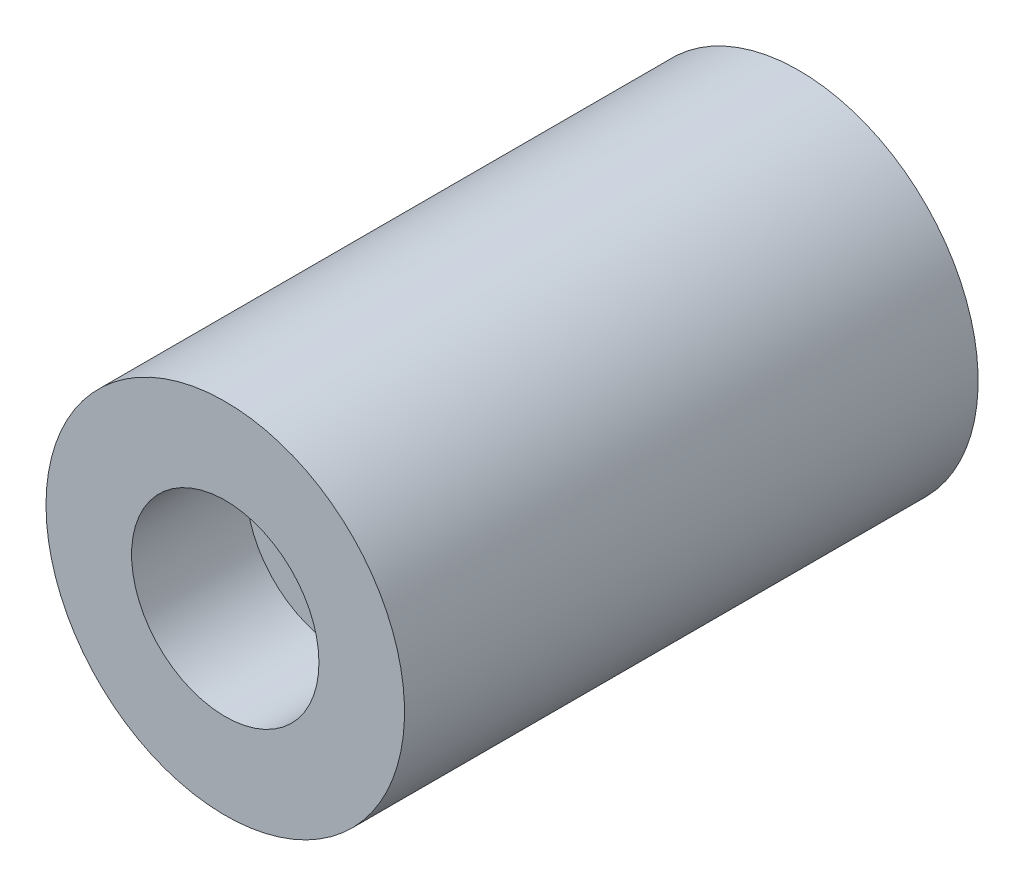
ISO-10303-21;
HEADER;
FILE_DESCRIPTION(('STEP AP214'),'2;1');
FILE_NAME('part.step','',(''),(''),'','','');
FILE_SCHEMA(('AUTOMOTIVE_DESIGN { 1 0 10303 214 1 1 1 1 }'));
ENDSEC;
DATA;
#1=APPLICATION_CONTEXT('core data for automotive mechanical design processes');
#2=APPLICATION_PROTOCOL_DEFINITION('international standard','automotive_design',2000,#1);
#3=PRODUCT_CONTEXT('',#1,'mechanical');
#4=PRODUCT('Part','Part','',(#3));
#5=PRODUCT_RELATED_PRODUCT_CATEGORY('part','',(#4));
#6=PRODUCT_DEFINITION_FORMATION('','',#4);
#7=PRODUCT_DEFINITION_CONTEXT('part definition',#1,'design');
#8=PRODUCT_DEFINITION('design','',#6,#7);
#9=PRODUCT_DEFINITION_SHAPE('','',#8);
#10=(LENGTH_UNIT() NAMED_UNIT(*) SI_UNIT(.MILLI.,.METRE.));
#11=(NAMED_UNIT(*) PLANE_ANGLE_UNIT() SI_UNIT($,.RADIAN.));
#12=(NAMED_UNIT(*) SI_UNIT($,.STERADIAN.) SOLID_ANGLE_UNIT());
#13=UNCERTAINTY_MEASURE_WITH_UNIT(LENGTH_MEASURE(1.E-05),#10,'distance_accuracy_value','');
#14=(GEOMETRIC_REPRESENTATION_CONTEXT(3) GLOBAL_UNCERTAINTY_ASSIGNED_CONTEXT((#13)) GLOBAL_UNIT_ASSIGNED_CONTEXT((#10,
#11,#12)) REPRESENTATION_CONTEXT('',''));
#15=CARTESIAN_POINT('',(0.,0.,0.));
#16=DIRECTION('',(0.,0.,1.));
#17=DIRECTION('',(1.,0.,0.));
#18=AXIS2_PLACEMENT_3D('',#15,#16,#17);
#19=CARTESIAN_POINT('',(0.,0.,7.62));
#20=DIRECTION('',(0.,0.,-0.999999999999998));
#21=DIRECTION('',(-1.00000000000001,0.,0.));
#22=AXIS2_PLACEMENT_3D('',#19,#20,#21);
#23=CYLINDRICAL_SURFACE('',#22,2.38125);
#24=CARTESIAN_POINT('',(0.,0.,7.62));
#25=DIRECTION('',(0.,0.,0.999999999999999));
#26=DIRECTION('',(1.00000000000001,0.,0.));
#27=AXIS2_PLACEMENT_3D('',#24,#25,#26);
#28=CIRCLE('',#27,2.38125);
#29=CARTESIAN_POINT('',(-2.38125000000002,0.,7.62));
#30=VERTEX_POINT('',#29);
#31=EDGE_CURVE('E11',#30,#30,#28,.T.);
#32=CARTESIAN_POINT('',(0.,0.,0.));
#33=DIRECTION('',(0.,0.,0.999999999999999));
#34=DIRECTION('',(1.00000000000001,0.,0.));
#35=AXIS2_PLACEMENT_3D('',#32,#33,#34);
#36=CIRCLE('',#35,2.38125);
#37=CARTESIAN_POINT('',(-2.38125000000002,0.,0.));
#38=VERTEX_POINT('',#37);
#39=EDGE_CURVE('E38',#38,#38,#36,.T.);
#40=CARTESIAN_POINT('',(-2.38125000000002,0.,7.62));
#41=CARTESIAN_POINT('',(-2.38125000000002,0.,7.540625));
#42=CARTESIAN_POINT('',(-2.38125000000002,0.,7.46125));
#43=CARTESIAN_POINT('',(-2.38125000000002,0.,7.3025));
#44=CARTESIAN_POINT('',(-2.38125000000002,0.,7.223125));
#45=CARTESIAN_POINT('',(-2.38125000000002,0.,7.064375));
#46=CARTESIAN_POINT('',(-2.38125000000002,0.,6.985));
#47=CARTESIAN_POINT('',(-2.38125000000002,0.,6.82625));
#48=CARTESIAN_POINT('',(-2.38125000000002,0.,6.746875));
#49=CARTESIAN_POINT('',(-2.38125000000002,0.,6.588125));
#50=CARTESIAN_POINT('',(-2.38125000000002,0.,6.50875));
#51=CARTESIAN_POINT('',(-2.38125000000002,0.,6.35));
#52=CARTESIAN_POINT('',(-2.38125000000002,0.,6.270625));
#53=CARTESIAN_POINT('',(-2.38125000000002,0.,6.111875));
#54=CARTESIAN_POINT('',(-2.38125000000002,0.,6.0325));
#55=CARTESIAN_POINT('',(-2.38125000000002,0.,5.87375));
#56=CARTESIAN_POINT('',(-2.38125000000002,0.,5.794375));
#57=CARTESIAN_POINT('',(-2.38125000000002,0.,5.635625));
#58=CARTESIAN_POINT('',(-2.38125000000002,0.,5.55625));
#59=CARTESIAN_POINT('',(-2.38125000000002,0.,5.3975));
#60=CARTESIAN_POINT('',(-2.38125000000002,0.,5.318125));
#61=CARTESIAN_POINT('',(-2.38125000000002,0.,5.159375));
#62=CARTESIAN_POINT('',(-2.38125000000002,0.,5.08));
#63=CARTESIAN_POINT('',(-2.38125000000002,0.,4.92125));
#64=CARTESIAN_POINT('',(-2.38125000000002,0.,4.841875));
#65=CARTESIAN_POINT('',(-2.38125000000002,0.,4.683125));
#66=CARTESIAN_POINT('',(-2.38125000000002,0.,4.60375));
#67=CARTESIAN_POINT('',(-2.38125000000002,0.,4.445));
#68=CARTESIAN_POINT('',(-2.38125000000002,0.,4.365625));
#69=CARTESIAN_POINT('',(-2.38125000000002,0.,4.206875));
#70=CARTESIAN_POINT('',(-2.38125000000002,0.,4.1275));
#71=CARTESIAN_POINT('',(-2.38125000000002,0.,3.96875));
#72=CARTESIAN_POINT('',(-2.38125000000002,0.,3.889375));
#73=CARTESIAN_POINT('',(-2.38125000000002,0.,3.730625));
#74=CARTESIAN_POINT('',(-2.38125000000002,0.,3.65125));
#75=CARTESIAN_POINT('',(-2.38125000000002,0.,3.4925));
#76=CARTESIAN_POINT('',(-2.38125000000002,0.,3.413125));
#77=CARTESIAN_POINT('',(-2.38125000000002,0.,3.254375));
#78=CARTESIAN_POINT('',(-2.38125000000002,0.,3.175));
#79=CARTESIAN_POINT('',(-2.38125000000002,0.,3.01625));
#80=CARTESIAN_POINT('',(-2.38125000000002,0.,2.936875));
#81=CARTESIAN_POINT('',(-2.38125000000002,0.,2.778125));
#82=CARTESIAN_POINT('',(-2.38125000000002,0.,2.69875));
#83=CARTESIAN_POINT('',(-2.38125000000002,0.,2.54));
#84=CARTESIAN_POINT('',(-2.38125000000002,0.,2.460625));
#85=CARTESIAN_POINT('',(-2.38125000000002,0.,2.301875));
#86=CARTESIAN_POINT('',(-2.38125000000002,0.,2.2225));
#87=CARTESIAN_POINT('',(-2.38125000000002,0.,2.06375));
#88=CARTESIAN_POINT('',(-2.38125000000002,0.,1.984375));
#89=CARTESIAN_POINT('',(-2.38125000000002,0.,1.825625));
#90=CARTESIAN_POINT('',(-2.38125000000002,0.,1.74625));
#91=CARTESIAN_POINT('',(-2.38125000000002,0.,1.5875));
#92=CARTESIAN_POINT('',(-2.38125000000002,0.,1.508125));
#93=CARTESIAN_POINT('',(-2.38125000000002,0.,1.349375));
#94=CARTESIAN_POINT('',(-2.38125000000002,0.,1.27));
#95=CARTESIAN_POINT('',(-2.38125000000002,0.,1.11125));
#96=CARTESIAN_POINT('',(-2.38125000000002,0.,1.031875));
#97=CARTESIAN_POINT('',(-2.38125000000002,0.,0.873125));
#98=CARTESIAN_POINT('',(-2.38125000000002,0.,0.79375));
#99=CARTESIAN_POINT('',(-2.38125000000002,0.,0.635));
#100=CARTESIAN_POINT('',(-2.38125000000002,0.,0.555625));
#101=CARTESIAN_POINT('',(-2.38125000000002,0.,0.396875));
#102=CARTESIAN_POINT('',(-2.38125000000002,0.,0.3175));
#103=CARTESIAN_POINT('',(-2.38125000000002,0.,0.15875));
#104=CARTESIAN_POINT('',(-2.38125000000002,0.,0.0793749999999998));
#105=CARTESIAN_POINT('',(-2.38125000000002,0.,0.));
#106=B_SPLINE_CURVE_WITH_KNOTS('',3,(#40,#41,#42,#43,#44,#45,#46,#47,#48,#49,#50,#51,#52,#53,
#54,#55,#56,#57,#58,#59,#60,#61,#62,#63,#64,#65,#66,#67,#68,#69,#70,#71,#72,#73,#74,#75,#76,#77,
#78,#79,#80,#81,#82,#83,#84,#85,#86,#87,#88,#89,#90,#91,#92,#93,#94,#95,#96,#97,#98,#99,#100,
#101,#102,#103,#104,#105),.UNSPECIFIED.,.F.,.F.,(4,2,2,2,2,2,2,2,2,2,2,2,2,2,2,2,2,2,2,2,2,2,2,
2,2,2,2,2,2,2,2,2,4),(0.,0.238125,0.476250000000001,0.714375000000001,0.952500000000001,
1.190625,1.42875,1.666875,1.905,2.143125,2.38125,2.619375,2.8575,3.095625,3.33375,3.571875,3.81,
4.048125,4.28625,4.524375,4.7625,5.000625,5.23875,5.476875,5.715,5.953125,6.19125,6.429375,
6.6675,6.90562500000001,7.14375,7.381875,7.62),.UNSPECIFIED.);
#107=EDGE_CURVE('BSEAM32',#30,#38,#106,.T.);
#108=ORIENTED_EDGE('',*,*,#31,.F.);
#109=ORIENTED_EDGE('',*,*,#39,.T.);
#110=ORIENTED_EDGE('',*,*,#107,.T.);
#111=ORIENTED_EDGE('',*,*,#107,.F.);
#112=EDGE_LOOP('',(#108,#110,#109,#111));
#113=FACE_BOUND('',#112,.T.);
#114=ADVANCED_FACE('F32',(#113),#23,.T.);
#115=CARTESIAN_POINT('',(0.,0.,7.62));
#116=DIRECTION('',(0.,0.,0.999999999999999));
#117=DIRECTION('',(1.00000000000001,0.,0.));
#118=AXIS2_PLACEMENT_3D('',#115,#116,#117);
#119=PLANE('',#118);
#120=CARTESIAN_POINT('',(0.,0.,7.62));
#121=DIRECTION('',(0.,0.,0.999999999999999));
#122=DIRECTION('',(1.00000000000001,0.,0.));
#123=AXIS2_PLACEMENT_3D('',#120,#121,#122);
#124=CIRCLE('',#123,1.2446);
#125=CARTESIAN_POINT('',(1.2446,0.,7.62));
#126=VERTEX_POINT('',#125);
#127=EDGE_CURVE('E51',#126,#126,#124,.T.);
#128=ORIENTED_EDGE('',*,*,#127,.F.);
#129=EDGE_LOOP('',(#128));
#130=FACE_BOUND('',#129,.T.);
#131=ORIENTED_EDGE('',*,*,#31,.T.);
#132=EDGE_LOOP('',(#131));
#133=FACE_BOUND('',#132,.T.);
#134=ADVANCED_FACE('F68',(#130,#133),#119,.T.);
#135=CARTESIAN_POINT('',(0.,0.,0.));
#136=DIRECTION('',(0.,0.,0.999999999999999));
#137=DIRECTION('',(1.00000000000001,0.,0.));
#138=AXIS2_PLACEMENT_3D('',#135,#136,#137);
#139=PLANE('',#138);
#140=CARTESIAN_POINT('',(0.,0.,0.));
#141=DIRECTION('',(0.,0.,-0.999999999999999));
#142=DIRECTION('',(-1.00000000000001,0.,0.));
#143=AXIS2_PLACEMENT_3D('',#140,#141,#142);
#144=CIRCLE('',#143,1.72719999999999);
#145=CARTESIAN_POINT('',(-1.7272,0.,0.));
#146=VERTEX_POINT('',#145);
#147=EDGE_CURVE('E52',#146,#146,#144,.T.);
#148=ORIENTED_EDGE('',*,*,#147,.F.);
#149=EDGE_LOOP('',(#148));
#150=FACE_BOUND('',#149,.T.);
#151=ORIENTED_EDGE('',*,*,#39,.F.);
#152=EDGE_LOOP('',(#151));
#153=FACE_BOUND('',#152,.T.);
#154=ADVANCED_FACE('F65',(#150,#153),#139,.F.);
#155=CARTESIAN_POINT('',(0.,0.,6.096));
#156=DIRECTION('',(0.,0.,0.999999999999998));
#157=DIRECTION('',(1.00000000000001,0.,0.));
#158=AXIS2_PLACEMENT_3D('',#155,#156,#157);
#159=CYLINDRICAL_SURFACE('',#158,1.2446);
#160=CARTESIAN_POINT('',(0.,0.,6.096));
#161=DIRECTION('',(0.,0.,0.999999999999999));
#162=DIRECTION('',(1.00000000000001,0.,0.));
#163=AXIS2_PLACEMENT_3D('',#160,#161,#162);
#164=CIRCLE('',#163,1.2446);
#165=CARTESIAN_POINT('',(1.2446,0.,6.096));
#166=VERTEX_POINT('',#165);
#167=EDGE_CURVE('E55',#166,#166,#164,.T.);
#168=CARTESIAN_POINT('',(1.2446,0.,6.096));
#169=CARTESIAN_POINT('',(1.2446,0.,6.111875));
#170=CARTESIAN_POINT('',(1.2446,0.,6.12775));
#171=CARTESIAN_POINT('',(1.2446,0.,6.1595));
#172=CARTESIAN_POINT('',(1.2446,0.,6.175375));
#173=CARTESIAN_POINT('',(1.2446,0.,6.207125));
#174=CARTESIAN_POINT('',(1.2446,0.,6.223));
#175=CARTESIAN_POINT('',(1.2446,0.,6.25475));
#176=CARTESIAN_POINT('',(1.2446,0.,6.270625));
#177=CARTESIAN_POINT('',(1.2446,0.,6.302375));
#178=CARTESIAN_POINT('',(1.2446,0.,6.31825));
#179=CARTESIAN_POINT('',(1.2446,0.,6.35));
#180=CARTESIAN_POINT('',(1.2446,0.,6.365875));
#181=CARTESIAN_POINT('',(1.2446,0.,6.397625));
#182=CARTESIAN_POINT('',(1.2446,0.,6.4135));
#183=CARTESIAN_POINT('',(1.2446,0.,6.44525));
#184=CARTESIAN_POINT('',(1.2446,0.,6.461125));
#185=CARTESIAN_POINT('',(1.2446,0.,6.492875));
#186=CARTESIAN_POINT('',(1.2446,0.,6.50875));
#187=CARTESIAN_POINT('',(1.2446,0.,6.5405));
#188=CARTESIAN_POINT('',(1.2446,0.,6.556375));
#189=CARTESIAN_POINT('',(1.2446,0.,6.588125));
#190=CARTESIAN_POINT('',(1.2446,0.,6.604));
#191=CARTESIAN_POINT('',(1.2446,0.,6.63575));
#192=CARTESIAN_POINT('',(1.2446,0.,6.651625));
#193=CARTESIAN_POINT('',(1.2446,0.,6.683375));
#194=CARTESIAN_POINT('',(1.2446,0.,6.69925));
#195=CARTESIAN_POINT('',(1.2446,0.,6.731));
#196=CARTESIAN_POINT('',(1.2446,0.,6.746875));
#197=CARTESIAN_POINT('',(1.2446,0.,6.778625));
#198=CARTESIAN_POINT('',(1.2446,0.,6.7945));
#199=CARTESIAN_POINT('',(1.2446,0.,6.82625));
#200=CARTESIAN_POINT('',(1.2446,0.,6.842125));
#201=CARTESIAN_POINT('',(1.2446,0.,6.873875));
#202=CARTESIAN_POINT('',(1.2446,0.,6.88975));
#203=CARTESIAN_POINT('',(1.2446,0.,6.9215));
#204=CARTESIAN_POINT('',(1.2446,0.,6.937375));
#205=CARTESIAN_POINT('',(1.2446,0.,6.969125));
#206=CARTESIAN_POINT('',(1.2446,0.,6.985));
#207=CARTESIAN_POINT('',(1.2446,0.,7.01675));
#208=CARTESIAN_POINT('',(1.2446,0.,7.032625));
#209=CARTESIAN_POINT('',(1.2446,0.,7.064375));
#210=CARTESIAN_POINT('',(1.2446,0.,7.08025));
#211=CARTESIAN_POINT('',(1.2446,0.,7.112));
#212=CARTESIAN_POINT('',(1.2446,0.,7.127875));
#213=CARTESIAN_POINT('',(1.2446,0.,7.159625));
#214=CARTESIAN_POINT('',(1.2446,0.,7.1755));
#215=CARTESIAN_POINT('',(1.2446,0.,7.20725));
#216=CARTESIAN_POINT('',(1.2446,0.,7.223125));
#217=CARTESIAN_POINT('',(1.2446,0.,7.254875));
#218=CARTESIAN_POINT('',(1.2446,0.,7.27075));
#219=CARTESIAN_POINT('',(1.2446,0.,7.3025));
#220=CARTESIAN_POINT('',(1.2446,0.,7.318375));
#221=CARTESIAN_POINT('',(1.2446,0.,7.350125));
#222=CARTESIAN_POINT('',(1.2446,0.,7.366));
#223=CARTESIAN_POINT('',(1.2446,0.,7.39775));
#224=CARTESIAN_POINT('',(1.2446,0.,7.413625));
#225=CARTESIAN_POINT('',(1.2446,0.,7.445375));
#226=CARTESIAN_POINT('',(1.2446,0.,7.46125));
#227=CARTESIAN_POINT('',(1.2446,0.,7.493));
#228=CARTESIAN_POINT('',(1.2446,0.,7.508875));
#229=CARTESIAN_POINT('',(1.2446,0.,7.540625));
#230=CARTESIAN_POINT('',(1.2446,0.,7.5565));
#231=CARTESIAN_POINT('',(1.2446,0.,7.58825));
#232=CARTESIAN_POINT('',(1.2446,0.,7.604125));
#233=CARTESIAN_POINT('',(1.2446,0.,7.62));
#234=B_SPLINE_CURVE_WITH_KNOTS('',3,(#168,#169,#170,#171,#172,#173,#174,#175,#176,#177,#178,
#179,#180,#181,#182,#183,#184,#185,#186,#187,#188,#189,#190,#191,#192,#193,#194,#195,#196,#197,
#198,#199,#200,#201,#202,#203,#204,#205,#206,#207,#208,#209,#210,#211,#212,#213,#214,#215,#216,
#217,#218,#219,#220,#221,#222,#223,#224,#225,#226,#227,#228,#229,#230,#231,#232,#233),
.UNSPECIFIED.,.F.,.F.,(4,2,2,2,2,2,2,2,2,2,2,2,2,2,2,2,2,2,2,2,2,2,2,2,2,2,2,2,2,2,2,2,4),(0.,
0.0476249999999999,0.0952499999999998,0.142875,0.1905,0.238125,0.28575,0.333375,0.381,
0.428625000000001,0.476250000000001,0.523875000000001,0.571500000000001,0.619125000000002,
0.666750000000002,0.714375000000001,0.762000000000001,0.809625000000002,0.857250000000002,
0.904875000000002,0.952500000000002,1.000125,1.04775,1.095375,1.143,1.190625,1.23825,1.285875,
1.3335,1.381125,1.42875,1.476375,1.524),.UNSPECIFIED.);
#235=EDGE_CURVE('BSEAM67',#166,#126,#234,.T.);
#236=ORIENTED_EDGE('',*,*,#167,.F.);
#237=ORIENTED_EDGE('',*,*,#127,.T.);
#238=ORIENTED_EDGE('',*,*,#235,.T.);
#239=ORIENTED_EDGE('',*,*,#235,.F.);
#240=EDGE_LOOP('',(#236,#238,#237,#239));
#241=FACE_BOUND('',#240,.T.);
#242=ADVANCED_FACE('F67',(#241),#159,.F.);
#243=CARTESIAN_POINT('',(0.,0.,6.096));
#244=DIRECTION('',(0.,0.,0.999999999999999));
#245=DIRECTION('',(1.00000000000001,0.,0.));
#246=AXIS2_PLACEMENT_3D('',#243,#244,#245);
#247=PLANE('',#246);
#248=ORIENTED_EDGE('',*,*,#167,.T.);
#249=EDGE_LOOP('',(#248));
#250=FACE_BOUND('',#249,.T.);
#251=ADVANCED_FACE('F45',(#250),#247,.T.);
#252=CARTESIAN_POINT('',(0.,0.,4.826));
#253=DIRECTION('',(0.,0.,-0.999999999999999));
#254=DIRECTION('',(-1.00000000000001,0.,0.));
#255=AXIS2_PLACEMENT_3D('',#252,#253,#254);
#256=CONICAL_SURFACE('',#255,1.7272,1.02974425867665);
#257=CARTESIAN_POINT('',(0.,0.,5.8638064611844));
#258=VERTEX_POINT('',#257);
#259=VERTEX_LOOP('',#258);
#260=FACE_BOUND('',#259,.T.);
#261=CARTESIAN_POINT('',(0.,0.,4.826));
#262=DIRECTION('',(0.,0.,-0.999999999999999));
#263=DIRECTION('',(-1.00000000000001,0.,0.));
#264=AXIS2_PLACEMENT_3D('',#261,#262,#263);
#265=CIRCLE('',#264,1.7272);
#266=CARTESIAN_POINT('',(-1.7272,0.,4.826));
#267=VERTEX_POINT('',#266);
#268=EDGE_CURVE('E49',#267,#267,#265,.T.);
#269=ORIENTED_EDGE('',*,*,#268,.T.);
#270=EDGE_LOOP('',(#269));
#271=FACE_BOUND('',#270,.T.);
#272=ADVANCED_FACE('F41',(#260,#271),#256,.F.);
#273=CARTESIAN_POINT('',(0.,0.,0.));
#274=DIRECTION('',(0.,0.,-0.999999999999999));
#275=DIRECTION('',(-1.00000000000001,0.,0.));
#276=AXIS2_PLACEMENT_3D('',#273,#274,#275);
#277=CYLINDRICAL_SURFACE('',#276,1.72719999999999);
#278=CARTESIAN_POINT('',(-1.7272,0.,4.826));
#279=CARTESIAN_POINT('',(-1.7272,0.,4.77572916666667));
#280=CARTESIAN_POINT('',(-1.7272,0.,4.72545833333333));
#281=CARTESIAN_POINT('',(-1.7272,0.,4.62491666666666));
#282=CARTESIAN_POINT('',(-1.7272,0.,4.57464583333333));
#283=CARTESIAN_POINT('',(-1.7272,0.,4.47410416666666));
#284=CARTESIAN_POINT('',(-1.7272,0.,4.42383333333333));
#285=CARTESIAN_POINT('',(-1.7272,0.,4.32329166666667));
#286=CARTESIAN_POINT('',(-1.7272,0.,4.27302083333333));
#287=CARTESIAN_POINT('',(-1.7272,0.,4.17247916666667));
#288=CARTESIAN_POINT('',(-1.7272,0.,4.12220833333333));
#289=CARTESIAN_POINT('',(-1.7272,0.,4.02166666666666));
#290=CARTESIAN_POINT('',(-1.7272,0.,3.97139583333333));
#291=CARTESIAN_POINT('',(-1.7272,0.,3.87085416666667));
#292=CARTESIAN_POINT('',(-1.7272,0.,3.82058333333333));
#293=CARTESIAN_POINT('',(-1.7272,0.,3.72004166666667));
#294=CARTESIAN_POINT('',(-1.7272,0.,3.66977083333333));
#295=CARTESIAN_POINT('',(-1.7272,0.,3.56922916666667));
#296=CARTESIAN_POINT('',(-1.7272,0.,3.51895833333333));
#297=CARTESIAN_POINT('',(-1.7272,0.,3.41841666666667));
#298=CARTESIAN_POINT('',(-1.7272,0.,3.36814583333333));
#299=CARTESIAN_POINT('',(-1.7272,0.,3.26760416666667));
#300=CARTESIAN_POINT('',(-1.7272,0.,3.21733333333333));
#301=CARTESIAN_POINT('',(-1.7272,0.,3.11679166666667));
#302=CARTESIAN_POINT('',(-1.7272,0.,3.06652083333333));
#303=CARTESIAN_POINT('',(-1.7272,0.,2.96597916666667));
#304=CARTESIAN_POINT('',(-1.7272,0.,2.91570833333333));
#305=CARTESIAN_POINT('',(-1.7272,0.,2.81516666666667));
#306=CARTESIAN_POINT('',(-1.7272,0.,2.76489583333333));
#307=CARTESIAN_POINT('',(-1.7272,0.,2.66435416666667));
#308=CARTESIAN_POINT('',(-1.7272,0.,2.61408333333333));
#309=CARTESIAN_POINT('',(-1.7272,0.,2.51354166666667));
#310=CARTESIAN_POINT('',(-1.7272,0.,2.46327083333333));
#311=CARTESIAN_POINT('',(-1.7272,0.,2.36272916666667));
#312=CARTESIAN_POINT('',(-1.7272,0.,2.31245833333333));
#313=CARTESIAN_POINT('',(-1.7272,0.,2.21191666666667));
#314=CARTESIAN_POINT('',(-1.7272,0.,2.16164583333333));
#315=CARTESIAN_POINT('',(-1.7272,0.,2.06110416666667));
#316=CARTESIAN_POINT('',(-1.7272,0.,2.01083333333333));
#317=CARTESIAN_POINT('',(-1.7272,0.,1.91029166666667));
#318=CARTESIAN_POINT('',(-1.7272,0.,1.86002083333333));
#319=CARTESIAN_POINT('',(-1.7272,0.,1.75947916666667));
#320=CARTESIAN_POINT('',(-1.7272,0.,1.70920833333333));
#321=CARTESIAN_POINT('',(-1.7272,0.,1.60866666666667));
#322=CARTESIAN_POINT('',(-1.7272,0.,1.55839583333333));
#323=CARTESIAN_POINT('',(-1.7272,0.,1.45785416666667));
#324=CARTESIAN_POINT('',(-1.7272,0.,1.40758333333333));
#325=CARTESIAN_POINT('',(-1.7272,0.,1.30704166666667));
#326=CARTESIAN_POINT('',(-1.7272,0.,1.25677083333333));
#327=CARTESIAN_POINT('',(-1.7272,0.,1.15622916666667));
#328=CARTESIAN_POINT('',(-1.7272,0.,1.10595833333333));
#329=CARTESIAN_POINT('',(-1.7272,0.,1.00541666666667));
#330=CARTESIAN_POINT('',(-1.7272,0.,0.955145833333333));
#331=CARTESIAN_POINT('',(-1.7272,0.,0.854604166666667));
#332=CARTESIAN_POINT('',(-1.7272,0.,0.804333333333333));
#333=CARTESIAN_POINT('',(-1.7272,0.,0.703791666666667));
#334=CARTESIAN_POINT('',(-1.7272,0.,0.653520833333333));
#335=CARTESIAN_POINT('',(-1.7272,0.,0.552979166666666));
#336=CARTESIAN_POINT('',(-1.7272,0.,0.502708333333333));
#337=CARTESIAN_POINT('',(-1.7272,0.,0.402166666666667));
#338=CARTESIAN_POINT('',(-1.7272,0.,0.351895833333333));
#339=CARTESIAN_POINT('',(-1.7272,0.,0.251354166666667));
#340=CARTESIAN_POINT('',(-1.7272,0.,0.201083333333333));
#341=CARTESIAN_POINT('',(-1.7272,0.,0.100541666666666));
#342=CARTESIAN_POINT('',(-1.7272,0.,0.0502708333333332));
#343=CARTESIAN_POINT('',(-1.7272,0.,0.));
#344=B_SPLINE_CURVE_WITH_KNOTS('',3,(#278,#279,#280,#281,#282,#283,#284,#285,#286,#287,#288,
#289,#290,#291,#292,#293,#294,#295,#296,#297,#298,#299,#300,#301,#302,#303,#304,#305,#306,#307,
#308,#309,#310,#311,#312,#313,#314,#315,#316,#317,#318,#319,#320,#321,#322,#323,#324,#325,#326,
#327,#328,#329,#330,#331,#332,#333,#334,#335,#336,#337,#338,#339,#340,#341,#342,#343),
.UNSPECIFIED.,.F.,.F.,(4,2,2,2,2,2,2,2,2,2,2,2,2,2,2,2,2,2,2,2,2,2,2,2,2,2,2,2,2,2,2,2,4),(0.,
0.1508125,0.301625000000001,0.4524375,0.60325,0.7540625,0.904875,1.0556875,1.2065,1.3573125,
1.508125,1.6589375,1.80975,1.9605625,2.111375,2.2621875,2.413,2.5638125,2.714625,2.8654375,
3.01625,3.1670625,3.317875,3.4686875,3.6195,3.7703125,3.921125,4.0719375,4.22275,4.3735625,
4.524375,4.6751875,4.826),.UNSPECIFIED.);
#345=EDGE_CURVE('BSEAM44',#267,#146,#344,.T.);
#346=ORIENTED_EDGE('',*,*,#268,.F.);
#347=ORIENTED_EDGE('',*,*,#147,.T.);
#348=ORIENTED_EDGE('',*,*,#345,.T.);
#349=ORIENTED_EDGE('',*,*,#345,.F.);
#350=EDGE_LOOP('',(#346,#348,#347,#349));
#351=FACE_BOUND('',#350,.T.);
#352=ADVANCED_FACE('F44',(#351),#277,.F.);
#353=CLOSED_SHELL('',(#114,#134,#154,#242,#251,#272,#352));
#354=MANIFOLD_SOLID_BREP('B2',#353);
#355=ADVANCED_BREP_SHAPE_REPRESENTATION('',(#18,#354),#14);
#356=SHAPE_DEFINITION_REPRESENTATION(#9,#355);
ENDSEC;
END-ISO-10303-21;
